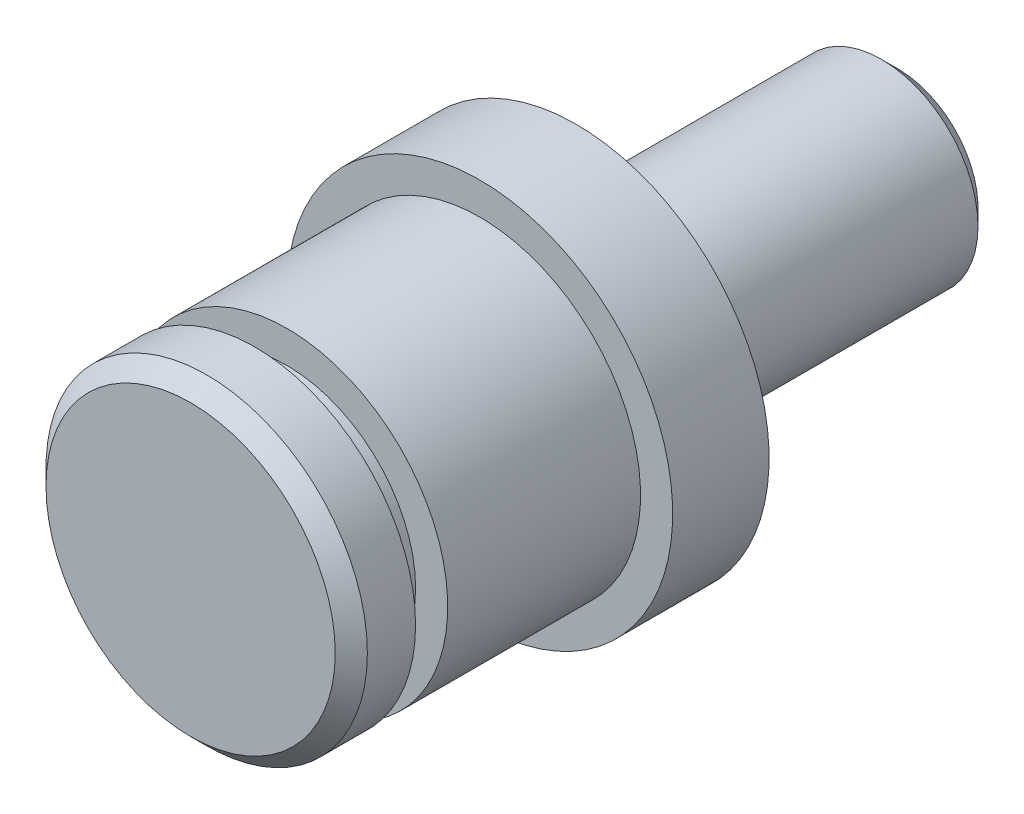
from build123d import *

# Parameters (mm, degrees)
ESQUISSE1_R        = 5
BOSS_EXTRU_1_DEPTH = 2
ESQUISSE2_R        = 4
BOSS_EXTRU_2_DEPTH = 1
BOSS_EXTRU_3_START = 6
ESQUISSE3_R        = 5
BOSS_EXTRU_3_DEPTH = 6
ESQUISSE4_R        = 6
BOSS_EXTRU_4_DEPTH = 3
ESQUISSE5_R        = 3
BOSS_EXTRU_5_DEPTH = 10
CHANFREIN1_SIZE    = 0.5
CHANFREIN2_SIZE    = 0.5
ESQUISSE6_R        = 0.5


with BuildPart() as part:
    # Esquisse1 → Boss.-Extru.1 (new body)
    with BuildSketch(Plane.XY):
        Circle(ESQUISSE1_R)
    extrude(amount=BOSS_EXTRU_1_DEPTH)

    # Esquisse2 → Boss.-Extru.2 (add)
    with BuildSketch(Plane(origin=(0, 0, 0), x_dir=(-1, 0, 0), z_dir=(0, 0, -1))):
        with Locations(Location((0, 0, 0), (0, 0, 180))):
            Circle(ESQUISSE2_R)
    extrude(amount=BOSS_EXTRU_2_DEPTH)

    # Esquisse3 → Boss.-Extru.3 (add)
    with BuildSketch(Plane(origin=(0, 0, -1), x_dir=(-1, 0, 0), z_dir=(0, 0, -1)).offset(BOSS_EXTRU_3_START)):
        with Locations(Location((0, 0, 0), (0, 0, 180))):
            Circle(ESQUISSE3_R)
    extrude(amount=-BOSS_EXTRU_3_DEPTH)

    # Esquisse4 → Boss.-Extru.4 (add)
    with BuildSketch(Plane(origin=(0, 0, -7), x_dir=(-1, 0, 0), z_dir=(0, 0, -1))):
        Circle(ESQUISSE4_R)
    extrude(amount=BOSS_EXTRU_4_DEPTH)

    # Esquisse5 → Boss.-Extru.5 (add)
    with BuildSketch(Plane(origin=(0, 0, -10), x_dir=(-1, 0, 0), z_dir=(0, 0, -1))):
        Circle(ESQUISSE5_R)
    extrude(amount=BOSS_EXTRU_5_DEPTH)

    # Chanfrein1
    chanfrein1_edges = [part.edges().sort_by_distance(p)[0] for p in [
        (-5, 0, 2),
    ]]
    chamfer(chanfrein1_edges, length=CHANFREIN1_SIZE)

    # Chanfrein2
    chanfrein2_edges = [part.edges().sort_by_distance(p)[0] for p in [
        (3, 0, -20),
    ]]
    chamfer(chanfrein2_edges, length=CHANFREIN2_SIZE)

    # Esquisse6 → Enl_vement de mati_re-R_volution1 (revolve, cut)
    with BuildSketch(Plane(origin=(0, 0, 0), x_dir=(1, 0, 0), z_dir=(0, 1, 0))):
        with Locations((3, 10.5)):
            Circle(ESQUISSE6_R)
    revolve(axis=Axis((0, 0, 0), (0, 0, -1)), mode=Mode.SUBTRACT)


solid = part.part
